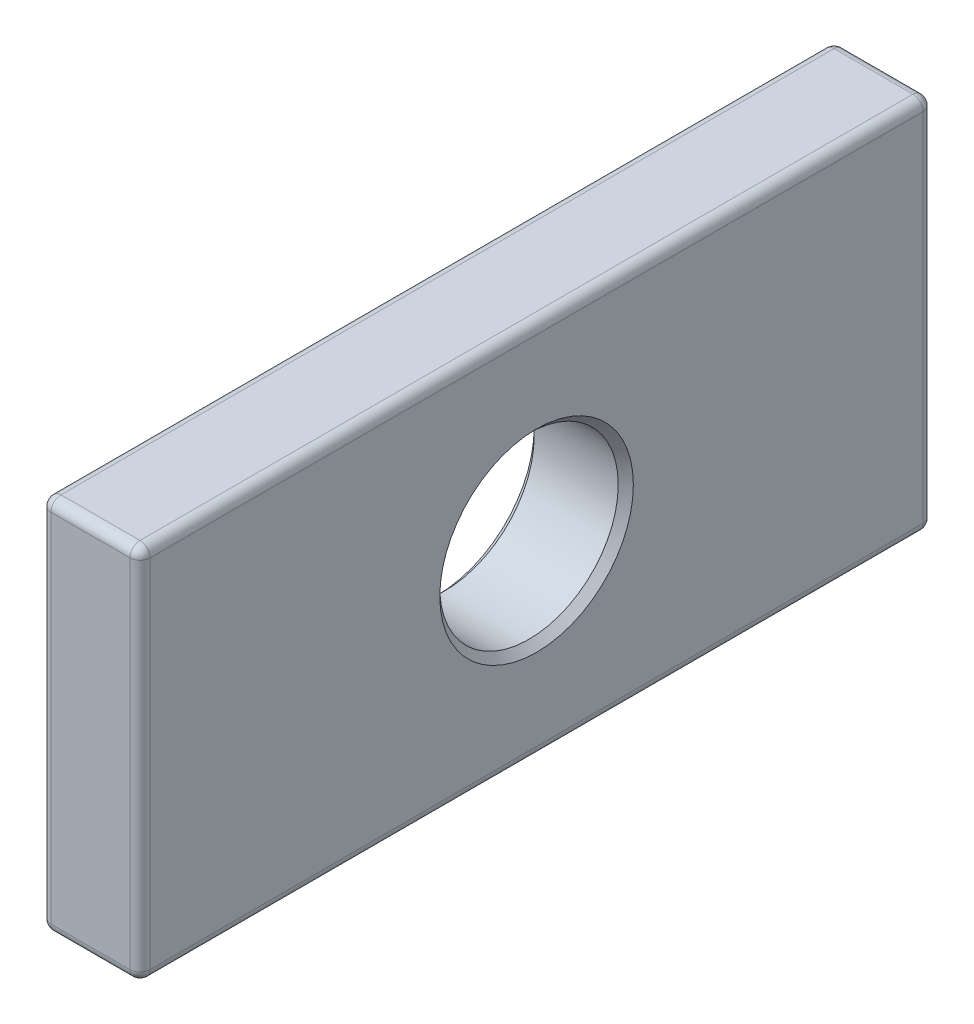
from build123d import *

# Parameters (mm, degrees)
SKETCH1_W           = 80
SKETCH1_H           = 38
SKETCH1_R           = 9
BOSS_EXTRUDE1_DEPTH = 5
FILLET1_R           = 1.016
CHAMFER1_SIZE       = 0.762


with BuildPart() as part:
    # Sketch1 → Boss-Extrude1 (new, symmetric)
    with BuildSketch(Plane(origin=(0, 0, 0), x_dir=(0, 0, -1), z_dir=(1, 0, 0))):
        Rectangle(SKETCH1_W, SKETCH1_H)
        Circle(SKETCH1_R, mode=Mode.SUBTRACT)
    extrude(amount=BOSS_EXTRUDE1_DEPTH, both=True)

    # Fillet1
    fillet1_edges = [part.edges().sort_by_distance(p)[0] for p in [
        (5, 0, 40),
        (5, -19, 0),
        (5, 0, -40),
        (-5, -19, 0),
        (-5, 0, 40),
        (-5, 19, 0),
        (-5, 0, -40),
        (5, 19, 0),
        (0, -19, -40),
        (0, -19, 40),
        (0, 19, 40),
        (0, 19, -40),
    ]]
    fillet(fillet1_edges, radius=FILLET1_R)

    # Chamfer1
    chamfer1_edges = [part.edges().sort_by_distance(p)[0] for p in [
        (-5, 0, 9),
        (5, 0, 9),
    ]]
    chamfer(chamfer1_edges, length=CHAMFER1_SIZE)


solid = part.part
